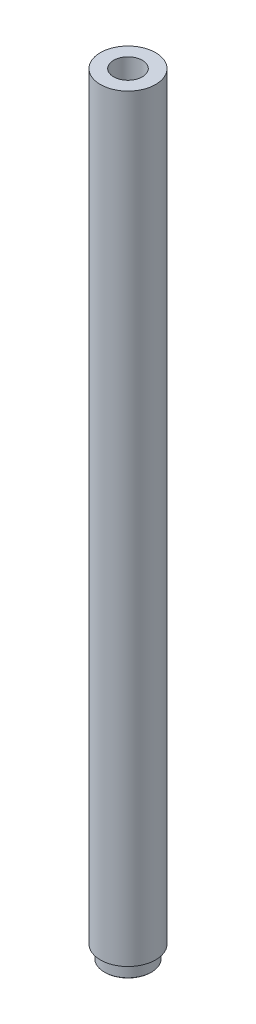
ISO-10303-21;
HEADER;
FILE_DESCRIPTION(('STEP AP214'),'2;1');
FILE_NAME('part.step','',(''),(''),'','','');
FILE_SCHEMA(('AUTOMOTIVE_DESIGN { 1 0 10303 214 1 1 1 1 }'));
ENDSEC;
DATA;
#1=APPLICATION_CONTEXT('core data for automotive mechanical design processes');
#2=APPLICATION_PROTOCOL_DEFINITION('international standard','automotive_design',2000,#1);
#3=PRODUCT_CONTEXT('',#1,'mechanical');
#4=PRODUCT('Part','Part','',(#3));
#5=PRODUCT_RELATED_PRODUCT_CATEGORY('part','',(#4));
#6=PRODUCT_DEFINITION_FORMATION('','',#4);
#7=PRODUCT_DEFINITION_CONTEXT('part definition',#1,'design');
#8=PRODUCT_DEFINITION('design','',#6,#7);
#9=PRODUCT_DEFINITION_SHAPE('','',#8);
#10=(LENGTH_UNIT() NAMED_UNIT(*) SI_UNIT(.MILLI.,.METRE.));
#11=(NAMED_UNIT(*) PLANE_ANGLE_UNIT() SI_UNIT($,.RADIAN.));
#12=(NAMED_UNIT(*) SI_UNIT($,.STERADIAN.) SOLID_ANGLE_UNIT());
#13=UNCERTAINTY_MEASURE_WITH_UNIT(LENGTH_MEASURE(1.E-05),#10,'distance_accuracy_value','');
#14=(GEOMETRIC_REPRESENTATION_CONTEXT(3) GLOBAL_UNCERTAINTY_ASSIGNED_CONTEXT((#13)) GLOBAL_UNIT_ASSIGNED_CONTEXT((#10,
#11,#12)) REPRESENTATION_CONTEXT('',''));
#15=CARTESIAN_POINT('',(0.,0.,0.));
#16=DIRECTION('',(0.,0.,1.));
#17=DIRECTION('',(1.,0.,0.));
#18=AXIS2_PLACEMENT_3D('',#15,#16,#17);
#19=CARTESIAN_POINT('',(0.,-87.1347,0.));
#20=DIRECTION('',(0.,1.,0.));
#21=DIRECTION('',(0.,0.,1.));
#22=AXIS2_PLACEMENT_3D('',#19,#20,#21);
#23=PLANE('',#22);
#24=CARTESIAN_POINT('',(0.,-87.1347,0.));
#25=DIRECTION('',(0.,1.,0.));
#26=DIRECTION('',(0.,0.,1.));
#27=AXIS2_PLACEMENT_3D('',#24,#25,#26);
#28=CIRCLE('',#27,6.35);
#29=CARTESIAN_POINT('',(0.,-87.1347,6.35));
#30=VERTEX_POINT('',#29);
#31=EDGE_CURVE('E48',#30,#30,#28,.T.);
#32=ORIENTED_EDGE('',*,*,#31,.F.);
#33=EDGE_LOOP('',(#32));
#34=FACE_BOUND('',#33,.T.);
#35=CARTESIAN_POINT('',(0.,-87.1347,0.));
#36=DIRECTION('',(0.,1.,0.));
#37=DIRECTION('',(0.,0.,1.));
#38=AXIS2_PLACEMENT_3D('',#35,#36,#37);
#39=CIRCLE('',#38,5.3975);
#40=CARTESIAN_POINT('',(0.,-87.1347,5.3975));
#41=VERTEX_POINT('',#40);
#42=EDGE_CURVE('E41',#41,#41,#39,.F.);
#43=ORIENTED_EDGE('',*,*,#42,.F.);
#44=EDGE_LOOP('',(#43));
#45=FACE_BOUND('',#44,.T.);
#46=ADVANCED_FACE('F30',(#34,#45),#23,.F.);
#47=CARTESIAN_POINT('',(0.,87.1347,0.));
#48=DIRECTION('',(0.,1.,0.));
#49=DIRECTION('',(0.,0.,1.));
#50=AXIS2_PLACEMENT_3D('',#47,#48,#49);
#51=PLANE('',#50);
#52=CARTESIAN_POINT('',(0.,87.1347,0.));
#53=DIRECTION('',(0.,1.,0.));
#54=DIRECTION('',(0.,0.,1.));
#55=AXIS2_PLACEMENT_3D('',#52,#53,#54);
#56=CIRCLE('',#55,6.35);
#57=CARTESIAN_POINT('',(0.,87.1347,6.35));
#58=VERTEX_POINT('',#57);
#59=EDGE_CURVE('E45',#58,#58,#56,.T.);
#60=ORIENTED_EDGE('',*,*,#59,.T.);
#61=EDGE_LOOP('',(#60));
#62=FACE_BOUND('',#61,.T.);
#63=CARTESIAN_POINT('',(0.,87.1347,0.));
#64=DIRECTION('',(0.,1.,0.));
#65=DIRECTION('',(0.,0.,1.));
#66=AXIS2_PLACEMENT_3D('',#63,#64,#65);
#67=CIRCLE('',#66,3.302);
#68=CARTESIAN_POINT('',(0.,87.1347,3.302));
#69=VERTEX_POINT('',#68);
#70=EDGE_CURVE('E51',#69,#69,#67,.T.);
#71=ORIENTED_EDGE('',*,*,#70,.F.);
#72=EDGE_LOOP('',(#71));
#73=FACE_BOUND('',#72,.T.);
#74=ADVANCED_FACE('F75',(#62,#73),#51,.T.);
#75=CARTESIAN_POINT('',(0.,87.1347,0.));
#76=DIRECTION('',(0.,-1.,0.));
#77=DIRECTION('',(0.,0.,-1.));
#78=AXIS2_PLACEMENT_3D('',#75,#76,#77);
#79=CYLINDRICAL_SURFACE('',#78,6.35);
#80=ORIENTED_EDGE('',*,*,#59,.F.);
#81=EDGE_LOOP('',(#80));
#82=FACE_BOUND('',#81,.T.);
#83=ORIENTED_EDGE('',*,*,#31,.T.);
#84=EDGE_LOOP('',(#83));
#85=FACE_BOUND('',#84,.T.);
#86=ADVANCED_FACE('F71',(#82,#85),#79,.T.);
#87=CARTESIAN_POINT('',(0.,87.1347,0.));
#88=DIRECTION('',(0.,-1.,0.));
#89=DIRECTION('',(0.,0.,-1.));
#90=AXIS2_PLACEMENT_3D('',#87,#88,#89);
#91=CYLINDRICAL_SURFACE('',#90,3.302);
#92=ORIENTED_EDGE('',*,*,#70,.T.);
#93=EDGE_LOOP('',(#92));
#94=FACE_BOUND('',#93,.T.);
#95=CARTESIAN_POINT('',(0.,-90.1827,0.));
#96=DIRECTION('',(0.,-1.,0.));
#97=DIRECTION('',(0.,0.,-1.));
#98=AXIS2_PLACEMENT_3D('',#95,#96,#97);
#99=CIRCLE('',#98,3.302);
#100=CARTESIAN_POINT('',(0.,-90.1827,-3.302));
#101=VERTEX_POINT('',#100);
#102=EDGE_CURVE('E56',#101,#101,#99,.T.);
#103=ORIENTED_EDGE('',*,*,#102,.T.);
#104=EDGE_LOOP('',(#103));
#105=FACE_BOUND('',#104,.T.);
#106=ADVANCED_FACE('F60',(#94,#105),#91,.F.);
#107=CARTESIAN_POINT('',(0.,-90.1827,0.));
#108=DIRECTION('',(0.,-1.,0.));
#109=DIRECTION('',(0.,0.,-1.));
#110=AXIS2_PLACEMENT_3D('',#107,#108,#109);
#111=PLANE('',#110);
#112=CARTESIAN_POINT('',(0.,-90.1827,0.));
#113=DIRECTION('',(0.,-1.,0.));
#114=DIRECTION('',(0.,0.,-1.));
#115=AXIS2_PLACEMENT_3D('',#112,#113,#114);
#116=CIRCLE('',#115,5.27050000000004);
#117=CARTESIAN_POINT('',(0.,-90.1827,-5.27050000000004));
#118=VERTEX_POINT('',#117);
#119=EDGE_CURVE('E37',#118,#118,#116,.T.);
#120=ORIENTED_EDGE('',*,*,#119,.T.);
#121=EDGE_LOOP('',(#120));
#122=FACE_BOUND('',#121,.T.);
#123=ORIENTED_EDGE('',*,*,#102,.F.);
#124=EDGE_LOOP('',(#123));
#125=FACE_BOUND('',#124,.T.);
#126=ADVANCED_FACE('F62',(#122,#125),#111,.T.);
#127=CARTESIAN_POINT('',(0.,-90.1827,0.));
#128=DIRECTION('',(0.,1.,0.));
#129=DIRECTION('',(0.,0.,1.));
#130=AXIS2_PLACEMENT_3D('',#127,#128,#129);
#131=CYLINDRICAL_SURFACE('',#130,5.3975);
#132=CARTESIAN_POINT('',(0.,-90.0557,0.));
#133=DIRECTION('',(0.,-1.,0.));
#134=DIRECTION('',(0.,0.,-1.));
#135=AXIS2_PLACEMENT_3D('',#132,#133,#134);
#136=CIRCLE('',#135,5.3975);
#137=CARTESIAN_POINT('',(0.,-90.0557,5.3975));
#138=VERTEX_POINT('',#137);
#139=EDGE_CURVE('E10',#138,#138,#136,.F.);
#140=CARTESIAN_POINT('',(0.,-90.0557,5.3975));
#141=CARTESIAN_POINT('',(0.,-90.0252729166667,5.3975));
#142=CARTESIAN_POINT('',(0.,-89.9948458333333,5.3975));
#143=CARTESIAN_POINT('',(0.,-89.9339916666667,5.3975));
#144=CARTESIAN_POINT('',(0.,-89.9035645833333,5.3975));
#145=CARTESIAN_POINT('',(0.,-89.8427104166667,5.3975));
#146=CARTESIAN_POINT('',(0.,-89.8122833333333,5.3975));
#147=CARTESIAN_POINT('',(0.,-89.7514291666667,5.3975));
#148=CARTESIAN_POINT('',(0.,-89.7210020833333,5.3975));
#149=CARTESIAN_POINT('',(0.,-89.6601479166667,5.3975));
#150=CARTESIAN_POINT('',(0.,-89.6297208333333,5.3975));
#151=CARTESIAN_POINT('',(0.,-89.5688666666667,5.3975));
#152=CARTESIAN_POINT('',(0.,-89.5384395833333,5.3975));
#153=CARTESIAN_POINT('',(0.,-89.4775854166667,5.3975));
#154=CARTESIAN_POINT('',(0.,-89.4471583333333,5.3975));
#155=CARTESIAN_POINT('',(0.,-89.3863041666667,5.3975));
#156=CARTESIAN_POINT('',(0.,-89.3558770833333,5.3975));
#157=CARTESIAN_POINT('',(0.,-89.2950229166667,5.3975));
#158=CARTESIAN_POINT('',(0.,-89.2645958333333,5.3975));
#159=CARTESIAN_POINT('',(0.,-89.2037416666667,5.3975));
#160=CARTESIAN_POINT('',(0.,-89.1733145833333,5.3975));
#161=CARTESIAN_POINT('',(0.,-89.1124604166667,5.3975));
#162=CARTESIAN_POINT('',(0.,-89.0820333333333,5.3975));
#163=CARTESIAN_POINT('',(0.,-89.0211791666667,5.3975));
#164=CARTESIAN_POINT('',(0.,-88.9907520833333,5.3975));
#165=CARTESIAN_POINT('',(0.,-88.9298979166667,5.3975));
#166=CARTESIAN_POINT('',(0.,-88.8994708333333,5.3975));
#167=CARTESIAN_POINT('',(0.,-88.8386166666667,5.3975));
#168=CARTESIAN_POINT('',(0.,-88.8081895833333,5.3975));
#169=CARTESIAN_POINT('',(0.,-88.7473354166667,5.3975));
#170=CARTESIAN_POINT('',(0.,-88.7169083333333,5.3975));
#171=CARTESIAN_POINT('',(0.,-88.6560541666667,5.3975));
#172=CARTESIAN_POINT('',(0.,-88.6256270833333,5.3975));
#173=CARTESIAN_POINT('',(0.,-88.5647729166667,5.3975));
#174=CARTESIAN_POINT('',(0.,-88.5343458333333,5.3975));
#175=CARTESIAN_POINT('',(0.,-88.4734916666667,5.3975));
#176=CARTESIAN_POINT('',(0.,-88.4430645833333,5.3975));
#177=CARTESIAN_POINT('',(0.,-88.3822104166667,5.3975));
#178=CARTESIAN_POINT('',(0.,-88.3517833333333,5.3975));
#179=CARTESIAN_POINT('',(0.,-88.2909291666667,5.3975));
#180=CARTESIAN_POINT('',(0.,-88.2605020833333,5.3975));
#181=CARTESIAN_POINT('',(0.,-88.1996479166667,5.3975));
#182=CARTESIAN_POINT('',(0.,-88.1692208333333,5.3975));
#183=CARTESIAN_POINT('',(0.,-88.1083666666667,5.3975));
#184=CARTESIAN_POINT('',(0.,-88.0779395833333,5.3975));
#185=CARTESIAN_POINT('',(0.,-88.0170854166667,5.3975));
#186=CARTESIAN_POINT('',(0.,-87.9866583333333,5.3975));
#187=CARTESIAN_POINT('',(0.,-87.9258041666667,5.3975));
#188=CARTESIAN_POINT('',(0.,-87.8953770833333,5.3975));
#189=CARTESIAN_POINT('',(0.,-87.8345229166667,5.3975));
#190=CARTESIAN_POINT('',(0.,-87.8040958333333,5.3975));
#191=CARTESIAN_POINT('',(0.,-87.7432416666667,5.3975));
#192=CARTESIAN_POINT('',(0.,-87.7128145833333,5.3975));
#193=CARTESIAN_POINT('',(0.,-87.6519604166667,5.3975));
#194=CARTESIAN_POINT('',(0.,-87.6215333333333,5.3975));
#195=CARTESIAN_POINT('',(0.,-87.5606791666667,5.3975));
#196=CARTESIAN_POINT('',(0.,-87.5302520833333,5.3975));
#197=CARTESIAN_POINT('',(0.,-87.4693979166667,5.3975));
#198=CARTESIAN_POINT('',(0.,-87.4389708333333,5.3975));
#199=CARTESIAN_POINT('',(0.,-87.3781166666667,5.3975));
#200=CARTESIAN_POINT('',(0.,-87.3476895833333,5.3975));
#201=CARTESIAN_POINT('',(0.,-87.2868354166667,5.3975));
#202=CARTESIAN_POINT('',(0.,-87.2564083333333,5.3975));
#203=CARTESIAN_POINT('',(0.,-87.1955541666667,5.3975));
#204=CARTESIAN_POINT('',(0.,-87.1651270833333,5.3975));
#205=CARTESIAN_POINT('',(0.,-87.1347,5.3975));
#206=B_SPLINE_CURVE_WITH_KNOTS('',3,(#140,#141,#142,#143,#144,#145,#146,#147,#148,#149,#150,
#151,#152,#153,#154,#155,#156,#157,#158,#159,#160,#161,#162,#163,#164,#165,#166,#167,#168,#169,
#170,#171,#172,#173,#174,#175,#176,#177,#178,#179,#180,#181,#182,#183,#184,#185,#186,#187,#188,
#189,#190,#191,#192,#193,#194,#195,#196,#197,#198,#199,#200,#201,#202,#203,#204,#205),
.UNSPECIFIED.,.F.,.F.,(4,2,2,2,2,2,2,2,2,2,2,2,2,2,2,2,2,2,2,2,2,2,2,2,2,2,2,2,2,2,2,2,4),(0.,
0.0912812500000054,0.182562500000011,0.273843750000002,0.365125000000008,0.456406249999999,
0.547687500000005,0.63896875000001,0.730250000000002,0.821531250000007,0.912812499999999,
1.00409375,1.09537500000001,1.18665625,1.27793750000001,1.36921875,1.4605,1.55178125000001,
1.6430625,1.73434375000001,1.825625,1.91690625,2.00818750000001,2.09946875,2.19075000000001,
2.28203125,2.3733125,2.46459375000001,2.555875,2.64715625,2.7384375,2.82971875,
2.92100000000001),.UNSPECIFIED.);
#207=EDGE_CURVE('BSEAM64',#138,#41,#206,.T.);
#208=ORIENTED_EDGE('',*,*,#139,.T.);
#209=ORIENTED_EDGE('',*,*,#42,.T.);
#210=ORIENTED_EDGE('',*,*,#207,.T.);
#211=ORIENTED_EDGE('',*,*,#207,.F.);
#212=EDGE_LOOP('',(#208,#210,#209,#211));
#213=FACE_BOUND('',#212,.T.);
#214=ADVANCED_FACE('F64',(#213),#131,.T.);
#215=CARTESIAN_POINT('',(0.,-90.1827,0.));
#216=DIRECTION('',(0.,1.,0.));
#217=DIRECTION('',(0.,0.,1.));
#218=AXIS2_PLACEMENT_3D('',#215,#216,#217);
#219=CONICAL_SURFACE('',#218,5.27050000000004,0.785398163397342);
#220=ORIENTED_EDGE('',*,*,#139,.F.);
#221=EDGE_LOOP('',(#220));
#222=FACE_BOUND('',#221,.T.);
#223=ORIENTED_EDGE('',*,*,#119,.F.);
#224=EDGE_LOOP('',(#223));
#225=FACE_BOUND('',#224,.T.);
#226=ADVANCED_FACE('F32',(#222,#225),#219,.T.);
#227=CLOSED_SHELL('',(#46,#74,#86,#106,#126,#214,#226));
#228=MANIFOLD_SOLID_BREP('B2',#227);
#229=ADVANCED_BREP_SHAPE_REPRESENTATION('',(#18,#228),#14);
#230=SHAPE_DEFINITION_REPRESENTATION(#9,#229);
ENDSEC;
END-ISO-10303-21;
